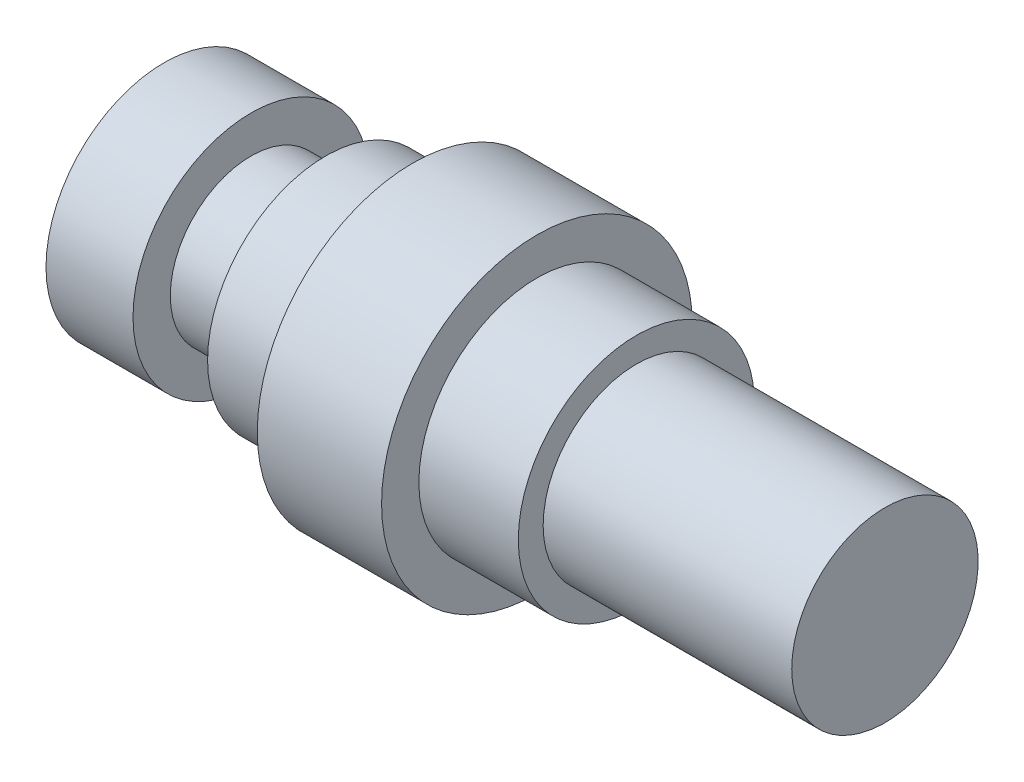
ISO-10303-21;
HEADER;
FILE_DESCRIPTION(('STEP AP214'),'2;1');
FILE_NAME('part.step','',(''),(''),'','','');
FILE_SCHEMA(('AUTOMOTIVE_DESIGN { 1 0 10303 214 1 1 1 1 }'));
ENDSEC;
DATA;
#1=APPLICATION_CONTEXT('core data for automotive mechanical design processes');
#2=APPLICATION_PROTOCOL_DEFINITION('international standard','automotive_design',2000,#1);
#3=PRODUCT_CONTEXT('',#1,'mechanical');
#4=PRODUCT('Part','Part','',(#3));
#5=PRODUCT_RELATED_PRODUCT_CATEGORY('part','',(#4));
#6=PRODUCT_DEFINITION_FORMATION('','',#4);
#7=PRODUCT_DEFINITION_CONTEXT('part definition',#1,'design');
#8=PRODUCT_DEFINITION('design','',#6,#7);
#9=PRODUCT_DEFINITION_SHAPE('','',#8);
#10=(LENGTH_UNIT() NAMED_UNIT(*) SI_UNIT(.MILLI.,.METRE.));
#11=(NAMED_UNIT(*) PLANE_ANGLE_UNIT() SI_UNIT($,.RADIAN.));
#12=(NAMED_UNIT(*) SI_UNIT($,.STERADIAN.) SOLID_ANGLE_UNIT());
#13=UNCERTAINTY_MEASURE_WITH_UNIT(LENGTH_MEASURE(1.E-05),#10,'distance_accuracy_value','');
#14=(GEOMETRIC_REPRESENTATION_CONTEXT(3) GLOBAL_UNCERTAINTY_ASSIGNED_CONTEXT((#13)) GLOBAL_UNIT_ASSIGNED_CONTEXT((#10,
#11,#12)) REPRESENTATION_CONTEXT('',''));
#15=CARTESIAN_POINT('',(0.,0.,0.));
#16=DIRECTION('',(0.,0.,1.));
#17=DIRECTION('',(1.,0.,0.));
#18=AXIS2_PLACEMENT_3D('',#15,#16,#17);
#19=CARTESIAN_POINT('',(-63.9448521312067,0.,0.));
#20=DIRECTION('',(1.,0.,0.));
#21=DIRECTION('',(0.,0.,-1.));
#22=AXIS2_PLACEMENT_3D('',#19,#20,#21);
#23=PLANE('',#22);
#24=CARTESIAN_POINT('',(-63.9448521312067,0.,0.));
#25=DIRECTION('',(-1.,0.,0.));
#26=DIRECTION('',(0.,0.,1.));
#27=AXIS2_PLACEMENT_3D('',#24,#25,#26);
#28=CIRCLE('',#27,7.125);
#29=CARTESIAN_POINT('',(-63.9448521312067,0.,7.125));
#30=VERTEX_POINT('',#29);
#31=EDGE_CURVE('E10',#30,#30,#28,.T.);
#32=ORIENTED_EDGE('',*,*,#31,.T.);
#33=EDGE_LOOP('',(#32));
#34=FACE_BOUND('',#33,.T.);
#35=ADVANCED_FACE('F35',(#34),#23,.F.);
#36=CARTESIAN_POINT('',(-69.4509496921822,0.,0.));
#37=DIRECTION('',(-1.,0.,0.));
#38=DIRECTION('',(0.,0.,1.));
#39=AXIS2_PLACEMENT_3D('',#36,#37,#38);
#40=CYLINDRICAL_SURFACE('',#39,7.125);
#41=ORIENTED_EDGE('',*,*,#31,.F.);
#42=EDGE_LOOP('',(#41));
#43=FACE_BOUND('',#42,.T.);
#44=CARTESIAN_POINT('',(-58.6948521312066,0.,0.));
#45=DIRECTION('',(-1.,0.,0.));
#46=DIRECTION('',(0.,0.,1.));
#47=AXIS2_PLACEMENT_3D('',#44,#45,#46);
#48=CIRCLE('',#47,7.125);
#49=CARTESIAN_POINT('',(-58.6948521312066,0.,7.125));
#50=VERTEX_POINT('',#49);
#51=EDGE_CURVE('E41',#50,#50,#48,.T.);
#52=ORIENTED_EDGE('',*,*,#51,.T.);
#53=EDGE_LOOP('',(#52));
#54=FACE_BOUND('',#53,.T.);
#55=ADVANCED_FACE('F91',(#43,#54),#40,.T.);
#56=CARTESIAN_POINT('',(-58.6948521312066,7.125,0.));
#57=DIRECTION('',(-1.,0.,0.));
#58=DIRECTION('',(0.,0.,1.));
#59=AXIS2_PLACEMENT_3D('',#56,#57,#58);
#60=PLANE('',#59);
#61=ORIENTED_EDGE('',*,*,#51,.F.);
#62=EDGE_LOOP('',(#61));
#63=FACE_BOUND('',#62,.T.);
#64=CARTESIAN_POINT('',(-58.6948521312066,0.,0.));
#65=DIRECTION('',(-1.,0.,0.));
#66=DIRECTION('',(0.,0.,1.));
#67=AXIS2_PLACEMENT_3D('',#64,#65,#66);
#68=CIRCLE('',#67,4.875);
#69=CARTESIAN_POINT('',(-58.6948521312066,0.,4.875));
#70=VERTEX_POINT('',#69);
#71=EDGE_CURVE('E45',#70,#70,#68,.T.);
#72=ORIENTED_EDGE('',*,*,#71,.T.);
#73=EDGE_LOOP('',(#72));
#74=FACE_BOUND('',#73,.T.);
#75=ADVANCED_FACE('F95',(#63,#74),#60,.F.);
#76=CARTESIAN_POINT('',(-69.4509496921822,0.,0.));
#77=DIRECTION('',(-1.,0.,0.));
#78=DIRECTION('',(0.,0.,1.));
#79=AXIS2_PLACEMENT_3D('',#76,#77,#78);
#80=CYLINDRICAL_SURFACE('',#79,4.875);
#81=ORIENTED_EDGE('',*,*,#71,.F.);
#82=EDGE_LOOP('',(#81));
#83=FACE_BOUND('',#82,.T.);
#84=CARTESIAN_POINT('',(-54.1948521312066,0.,0.));
#85=DIRECTION('',(-1.,0.,0.));
#86=DIRECTION('',(0.,0.,1.));
#87=AXIS2_PLACEMENT_3D('',#84,#85,#86);
#88=CIRCLE('',#87,4.875);
#89=CARTESIAN_POINT('',(-54.1948521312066,0.,4.875));
#90=VERTEX_POINT('',#89);
#91=EDGE_CURVE('E49',#90,#90,#88,.T.);
#92=ORIENTED_EDGE('',*,*,#91,.T.);
#93=EDGE_LOOP('',(#92));
#94=FACE_BOUND('',#93,.T.);
#95=ADVANCED_FACE('F100',(#83,#94),#80,.T.);
#96=CARTESIAN_POINT('',(-54.1948521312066,4.875,0.));
#97=DIRECTION('',(1.,0.,0.));
#98=DIRECTION('',(0.,0.,-1.));
#99=AXIS2_PLACEMENT_3D('',#96,#97,#98);
#100=PLANE('',#99);
#101=ORIENTED_EDGE('',*,*,#91,.F.);
#102=EDGE_LOOP('',(#101));
#103=FACE_BOUND('',#102,.T.);
#104=CARTESIAN_POINT('',(-54.1948521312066,0.,0.));
#105=DIRECTION('',(-1.,0.,0.));
#106=DIRECTION('',(0.,0.,1.));
#107=AXIS2_PLACEMENT_3D('',#104,#105,#106);
#108=CIRCLE('',#107,7.125);
#109=CARTESIAN_POINT('',(-54.1948521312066,0.,7.125));
#110=VERTEX_POINT('',#109);
#111=EDGE_CURVE('E54',#110,#110,#108,.T.);
#112=ORIENTED_EDGE('',*,*,#111,.T.);
#113=EDGE_LOOP('',(#112));
#114=FACE_BOUND('',#113,.T.);
#115=ADVANCED_FACE('F106',(#103,#114),#100,.F.);
#116=CARTESIAN_POINT('',(-69.4509496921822,0.,0.));
#117=DIRECTION('',(-1.,0.,0.));
#118=DIRECTION('',(0.,0.,1.));
#119=AXIS2_PLACEMENT_3D('',#116,#117,#118);
#120=CYLINDRICAL_SURFACE('',#119,7.125);
#121=ORIENTED_EDGE('',*,*,#111,.F.);
#122=EDGE_LOOP('',(#121));
#123=FACE_BOUND('',#122,.T.);
#124=CARTESIAN_POINT('',(-48.9448521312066,0.,0.));
#125=DIRECTION('',(-1.,0.,0.));
#126=DIRECTION('',(0.,0.,1.));
#127=AXIS2_PLACEMENT_3D('',#124,#125,#126);
#128=CIRCLE('',#127,7.125);
#129=CARTESIAN_POINT('',(-48.9448521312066,0.,7.125));
#130=VERTEX_POINT('',#129);
#131=EDGE_CURVE('E57',#130,#130,#128,.T.);
#132=ORIENTED_EDGE('',*,*,#131,.T.);
#133=EDGE_LOOP('',(#132));
#134=FACE_BOUND('',#133,.T.);
#135=ADVANCED_FACE('F110',(#123,#134),#120,.T.);
#136=CARTESIAN_POINT('',(-48.9448521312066,7.125,0.));
#137=DIRECTION('',(1.,0.,0.));
#138=DIRECTION('',(0.,0.,-1.));
#139=AXIS2_PLACEMENT_3D('',#136,#137,#138);
#140=PLANE('',#139);
#141=ORIENTED_EDGE('',*,*,#131,.F.);
#142=EDGE_LOOP('',(#141));
#143=FACE_BOUND('',#142,.T.);
#144=CARTESIAN_POINT('',(-48.9448521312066,0.,0.));
#145=DIRECTION('',(-1.,0.,0.));
#146=DIRECTION('',(0.,0.,1.));
#147=AXIS2_PLACEMENT_3D('',#144,#145,#146);
#148=CIRCLE('',#147,9.375);
#149=CARTESIAN_POINT('',(-48.9448521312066,0.,9.375));
#150=VERTEX_POINT('',#149);
#151=EDGE_CURVE('E60',#150,#150,#148,.T.);
#152=ORIENTED_EDGE('',*,*,#151,.T.);
#153=EDGE_LOOP('',(#152));
#154=FACE_BOUND('',#153,.T.);
#155=ADVANCED_FACE('F114',(#143,#154),#140,.F.);
#156=CARTESIAN_POINT('',(-69.4509496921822,0.,0.));
#157=DIRECTION('',(-1.,0.,0.));
#158=DIRECTION('',(0.,0.,1.));
#159=AXIS2_PLACEMENT_3D('',#156,#157,#158);
#160=CYLINDRICAL_SURFACE('',#159,9.375);
#161=ORIENTED_EDGE('',*,*,#151,.F.);
#162=EDGE_LOOP('',(#161));
#163=FACE_BOUND('',#162,.T.);
#164=CARTESIAN_POINT('',(-41.4448521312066,0.,0.));
#165=DIRECTION('',(-1.,0.,0.));
#166=DIRECTION('',(0.,0.,1.));
#167=AXIS2_PLACEMENT_3D('',#164,#165,#166);
#168=CIRCLE('',#167,9.375);
#169=CARTESIAN_POINT('',(-41.4448521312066,0.,9.375));
#170=VERTEX_POINT('',#169);
#171=EDGE_CURVE('E63',#170,#170,#168,.T.);
#172=ORIENTED_EDGE('',*,*,#171,.T.);
#173=EDGE_LOOP('',(#172));
#174=FACE_BOUND('',#173,.T.);
#175=ADVANCED_FACE('F118',(#163,#174),#160,.T.);
#176=CARTESIAN_POINT('',(-41.4448521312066,9.375,0.));
#177=DIRECTION('',(-1.,0.,0.));
#178=DIRECTION('',(0.,0.,1.));
#179=AXIS2_PLACEMENT_3D('',#176,#177,#178);
#180=PLANE('',#179);
#181=ORIENTED_EDGE('',*,*,#171,.F.);
#182=EDGE_LOOP('',(#181));
#183=FACE_BOUND('',#182,.T.);
#184=CARTESIAN_POINT('',(-41.4448521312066,0.,0.));
#185=DIRECTION('',(-1.,0.,0.));
#186=DIRECTION('',(0.,0.,1.));
#187=AXIS2_PLACEMENT_3D('',#184,#185,#186);
#188=CIRCLE('',#187,7.125);
#189=CARTESIAN_POINT('',(-41.4448521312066,0.,7.125));
#190=VERTEX_POINT('',#189);
#191=EDGE_CURVE('E66',#190,#190,#188,.T.);
#192=ORIENTED_EDGE('',*,*,#191,.T.);
#193=EDGE_LOOP('',(#192));
#194=FACE_BOUND('',#193,.T.);
#195=ADVANCED_FACE('F122',(#183,#194),#180,.F.);
#196=CARTESIAN_POINT('',(-69.4509496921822,0.,0.));
#197=DIRECTION('',(-1.,0.,0.));
#198=DIRECTION('',(0.,0.,1.));
#199=AXIS2_PLACEMENT_3D('',#196,#197,#198);
#200=CYLINDRICAL_SURFACE('',#199,7.125);
#201=ORIENTED_EDGE('',*,*,#191,.F.);
#202=EDGE_LOOP('',(#201));
#203=FACE_BOUND('',#202,.T.);
#204=CARTESIAN_POINT('',(-35.4448521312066,0.,0.));
#205=DIRECTION('',(-1.,0.,0.));
#206=DIRECTION('',(0.,0.,1.));
#207=AXIS2_PLACEMENT_3D('',#204,#205,#206);
#208=CIRCLE('',#207,7.125);
#209=CARTESIAN_POINT('',(-35.4448521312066,0.,7.125));
#210=VERTEX_POINT('',#209);
#211=EDGE_CURVE('E69',#210,#210,#208,.T.);
#212=ORIENTED_EDGE('',*,*,#211,.T.);
#213=EDGE_LOOP('',(#212));
#214=FACE_BOUND('',#213,.T.);
#215=ADVANCED_FACE('F126',(#203,#214),#200,.T.);
#216=CARTESIAN_POINT('',(-35.4448521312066,7.125,0.));
#217=DIRECTION('',(-1.,0.,0.));
#218=DIRECTION('',(0.,0.,1.));
#219=AXIS2_PLACEMENT_3D('',#216,#217,#218);
#220=PLANE('',#219);
#221=ORIENTED_EDGE('',*,*,#211,.F.);
#222=EDGE_LOOP('',(#221));
#223=FACE_BOUND('',#222,.T.);
#224=CARTESIAN_POINT('',(-35.4448521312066,0.,0.));
#225=DIRECTION('',(-1.,0.,0.));
#226=DIRECTION('',(0.,0.,1.));
#227=AXIS2_PLACEMENT_3D('',#224,#225,#226);
#228=CIRCLE('',#227,5.625);
#229=CARTESIAN_POINT('',(-35.4448521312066,0.,5.625));
#230=VERTEX_POINT('',#229);
#231=EDGE_CURVE('E72',#230,#230,#228,.T.);
#232=ORIENTED_EDGE('',*,*,#231,.T.);
#233=EDGE_LOOP('',(#232));
#234=FACE_BOUND('',#233,.T.);
#235=ADVANCED_FACE('F87',(#223,#234),#220,.F.);
#236=CARTESIAN_POINT('',(-69.4509496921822,0.,0.));
#237=DIRECTION('',(-1.,0.,0.));
#238=DIRECTION('',(0.,0.,1.));
#239=AXIS2_PLACEMENT_3D('',#236,#237,#238);
#240=CYLINDRICAL_SURFACE('',#239,5.625);
#241=ORIENTED_EDGE('',*,*,#231,.F.);
#242=EDGE_LOOP('',(#241));
#243=FACE_BOUND('',#242,.T.);
#244=CARTESIAN_POINT('',(-20.4448521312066,0.,0.));
#245=DIRECTION('',(-1.,0.,0.));
#246=DIRECTION('',(0.,0.,1.));
#247=AXIS2_PLACEMENT_3D('',#244,#245,#246);
#248=CIRCLE('',#247,5.625);
#249=CARTESIAN_POINT('',(-20.4448521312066,0.,5.625));
#250=VERTEX_POINT('',#249);
#251=EDGE_CURVE('E75',#250,#250,#248,.T.);
#252=ORIENTED_EDGE('',*,*,#251,.T.);
#253=EDGE_LOOP('',(#252));
#254=FACE_BOUND('',#253,.T.);
#255=ADVANCED_FACE('F79',(#243,#254),#240,.T.);
#256=CARTESIAN_POINT('',(-20.4448521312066,5.625,0.));
#257=DIRECTION('',(-1.,0.,0.));
#258=DIRECTION('',(0.,0.,1.));
#259=AXIS2_PLACEMENT_3D('',#256,#257,#258);
#260=PLANE('',#259);
#261=ORIENTED_EDGE('',*,*,#251,.F.);
#262=EDGE_LOOP('',(#261));
#263=FACE_BOUND('',#262,.T.);
#264=ADVANCED_FACE('F81',(#263),#260,.F.);
#265=CLOSED_SHELL('',(#35,#55,#75,#95,#115,#135,#155,#175,#195,#215,#235,#255,#264));
#266=MANIFOLD_SOLID_BREP('B2',#265);
#267=ADVANCED_BREP_SHAPE_REPRESENTATION('',(#18,#266),#14);
#268=SHAPE_DEFINITION_REPRESENTATION(#9,#267);
ENDSEC;
END-ISO-10303-21;
